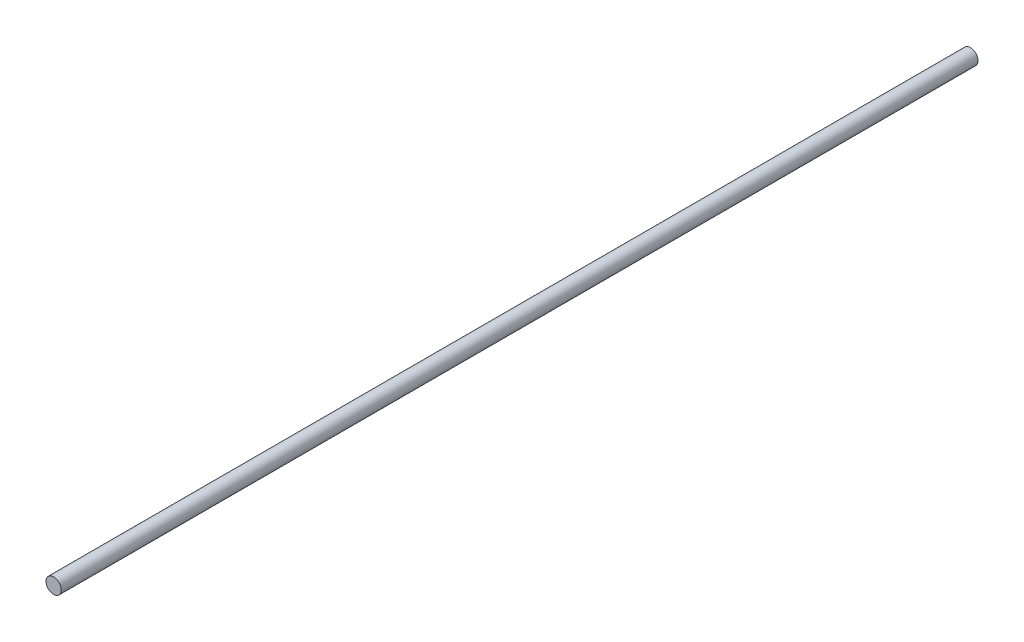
from build123d import *

# Parameters (mm, degrees)
SKETCH1_R           = 30
BOSS_EXTRUDE1_DEPTH = 3600


with BuildPart() as part:
    # Sketch1 → Boss-Extrude1 (new body)
    with BuildSketch(Plane.XY):
        Circle(SKETCH1_R)
    extrude(amount=-BOSS_EXTRUDE1_DEPTH)


solid = part.part
